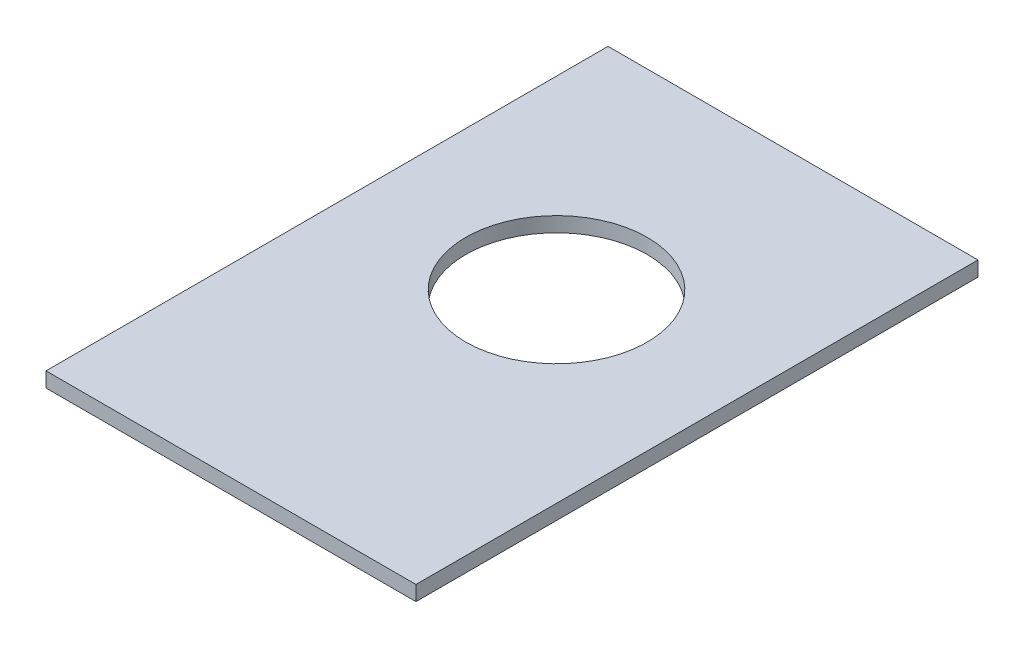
ISO-10303-21;
HEADER;
FILE_DESCRIPTION(('STEP AP214'),'2;1');
FILE_NAME('part.step','',(''),(''),'','','');
FILE_SCHEMA(('AUTOMOTIVE_DESIGN { 1 0 10303 214 1 1 1 1 }'));
ENDSEC;
DATA;
#1=APPLICATION_CONTEXT('core data for automotive mechanical design processes');
#2=APPLICATION_PROTOCOL_DEFINITION('international standard','automotive_design',2000,#1);
#3=PRODUCT_CONTEXT('',#1,'mechanical');
#4=PRODUCT('Part','Part','',(#3));
#5=PRODUCT_RELATED_PRODUCT_CATEGORY('part','',(#4));
#6=PRODUCT_DEFINITION_FORMATION('','',#4);
#7=PRODUCT_DEFINITION_CONTEXT('part definition',#1,'design');
#8=PRODUCT_DEFINITION('design','',#6,#7);
#9=PRODUCT_DEFINITION_SHAPE('','',#8);
#10=(LENGTH_UNIT() NAMED_UNIT(*) SI_UNIT(.MILLI.,.METRE.));
#11=(NAMED_UNIT(*) PLANE_ANGLE_UNIT() SI_UNIT($,.RADIAN.));
#12=(NAMED_UNIT(*) SI_UNIT($,.STERADIAN.) SOLID_ANGLE_UNIT());
#13=UNCERTAINTY_MEASURE_WITH_UNIT(LENGTH_MEASURE(1.E-05),#10,'distance_accuracy_value','');
#14=(GEOMETRIC_REPRESENTATION_CONTEXT(3) GLOBAL_UNCERTAINTY_ASSIGNED_CONTEXT((#13)) GLOBAL_UNIT_ASSIGNED_CONTEXT((#10,
#11,#12)) REPRESENTATION_CONTEXT('',''));
#15=CARTESIAN_POINT('',(0.,0.,0.));
#16=DIRECTION('',(0.,0.,1.));
#17=DIRECTION('',(1.,0.,0.));
#18=AXIS2_PLACEMENT_3D('',#15,#16,#17);
#19=CARTESIAN_POINT('',(-50.8,-16.792583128,-64.9508099));
#20=DIRECTION('',(0.,0.,1.));
#21=DIRECTION('',(1.,0.,0.));
#22=AXIS2_PLACEMENT_3D('',#19,#20,#21);
#23=PLANE('',#22);
#24=DIRECTION('',(1.,0.,0.));
#25=VECTOR('',#24,1.);
#26=CARTESIAN_POINT('',(0.,-12.7,-64.9508099));
#27=LINE('',#26,#25);
#28=CARTESIAN_POINT('',(-50.8,-12.7,-64.9508099));
#29=VERTEX_POINT('',#28);
#30=CARTESIAN_POINT('',(50.8,-12.7,-64.9508099));
#31=VERTEX_POINT('',#30);
#32=EDGE_CURVE('E45',#29,#31,#27,.T.);
#33=ORIENTED_EDGE('',*,*,#32,.T.);
#34=DIRECTION('',(0.,1.,0.));
#35=VECTOR('',#34,1.);
#36=CARTESIAN_POINT('',(50.8,-14.746291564,-64.9508099));
#37=LINE('',#36,#35);
#38=CARTESIAN_POINT('',(50.8,-16.792583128,-64.9508099));
#39=VERTEX_POINT('',#38);
#40=EDGE_CURVE('E72',#39,#31,#37,.T.);
#41=ORIENTED_EDGE('',*,*,#40,.F.);
#42=DIRECTION('',(-1.,0.,0.));
#43=VECTOR('',#42,1.);
#44=CARTESIAN_POINT('',(0.,-16.792583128,-64.9508099));
#45=LINE('',#44,#43);
#46=CARTESIAN_POINT('',(-50.8,-16.792583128,-64.9508099));
#47=VERTEX_POINT('',#46);
#48=EDGE_CURVE('E77',#39,#47,#45,.T.);
#49=ORIENTED_EDGE('',*,*,#48,.T.);
#50=DIRECTION('',(0.,1.,0.));
#51=VECTOR('',#50,1.);
#52=CARTESIAN_POINT('',(-50.8,-14.746291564,-64.9508099));
#53=LINE('',#52,#51);
#54=EDGE_CURVE('E51',#47,#29,#53,.T.);
#55=ORIENTED_EDGE('',*,*,#54,.T.);
#56=EDGE_LOOP('',(#33,#41,#49,#55));
#57=FACE_BOUND('',#56,.T.);
#58=ADVANCED_FACE('F15',(#57),#23,.F.);
#59=CARTESIAN_POINT('',(50.8,-16.792583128,89.3980392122));
#60=DIRECTION('',(1.,0.,0.));
#61=DIRECTION('',(0.,0.,-1.));
#62=AXIS2_PLACEMENT_3D('',#59,#60,#61);
#63=PLANE('',#62);
#64=ORIENTED_EDGE('',*,*,#40,.T.);
#65=DIRECTION('',(0.,0.,1.));
#66=VECTOR('',#65,1.);
#67=CARTESIAN_POINT('',(50.8,-12.7,12.2236146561));
#68=LINE('',#67,#66);
#69=CARTESIAN_POINT('',(50.8,-12.7,89.3980392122));
#70=VERTEX_POINT('',#69);
#71=EDGE_CURVE('E68',#31,#70,#68,.T.);
#72=ORIENTED_EDGE('',*,*,#71,.T.);
#73=DIRECTION('',(0.,-1.,0.));
#74=VECTOR('',#73,1.);
#75=CARTESIAN_POINT('',(50.8,-14.746291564,89.3980392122));
#76=LINE('',#75,#74);
#77=CARTESIAN_POINT('',(50.8,-16.792583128,89.3980392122));
#78=VERTEX_POINT('',#77);
#79=EDGE_CURVE('E65',#70,#78,#76,.T.);
#80=ORIENTED_EDGE('',*,*,#79,.T.);
#81=DIRECTION('',(0.,0.,-1.));
#82=VECTOR('',#81,1.);
#83=CARTESIAN_POINT('',(50.8,-16.792583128,12.2236146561));
#84=LINE('',#83,#82);
#85=EDGE_CURVE('E67',#78,#39,#84,.T.);
#86=ORIENTED_EDGE('',*,*,#85,.T.);
#87=EDGE_LOOP('',(#64,#72,#80,#86));
#88=FACE_BOUND('',#87,.T.);
#89=ADVANCED_FACE('F66',(#88),#63,.T.);
#90=CARTESIAN_POINT('',(50.8,-16.792583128,89.3980392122));
#91=DIRECTION('',(0.,0.,-1.));
#92=DIRECTION('',(-1.,0.,0.));
#93=AXIS2_PLACEMENT_3D('',#90,#91,#92);
#94=PLANE('',#93);
#95=DIRECTION('',(1.,0.,0.));
#96=VECTOR('',#95,1.);
#97=CARTESIAN_POINT('',(0.,-16.792583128,89.3980392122));
#98=LINE('',#97,#96);
#99=CARTESIAN_POINT('',(-50.8,-16.792583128,89.3980392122));
#100=VERTEX_POINT('',#99);
#101=EDGE_CURVE('E60',#100,#78,#98,.T.);
#102=ORIENTED_EDGE('',*,*,#101,.T.);
#103=ORIENTED_EDGE('',*,*,#79,.F.);
#104=DIRECTION('',(-1.,0.,0.));
#105=VECTOR('',#104,1.);
#106=CARTESIAN_POINT('',(0.,-12.7,89.3980392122));
#107=LINE('',#106,#105);
#108=CARTESIAN_POINT('',(-50.8,-12.7,89.3980392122));
#109=VERTEX_POINT('',#108);
#110=EDGE_CURVE('E86',#70,#109,#107,.T.);
#111=ORIENTED_EDGE('',*,*,#110,.T.);
#112=DIRECTION('',(0.,-1.,0.));
#113=VECTOR('',#112,1.);
#114=CARTESIAN_POINT('',(-50.8,-14.746291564,89.3980392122));
#115=LINE('',#114,#113);
#116=EDGE_CURVE('E32',#109,#100,#115,.T.);
#117=ORIENTED_EDGE('',*,*,#116,.T.);
#118=EDGE_LOOP('',(#102,#103,#111,#117));
#119=FACE_BOUND('',#118,.T.);
#120=ADVANCED_FACE('F79',(#119),#94,.F.);
#121=CARTESIAN_POINT('',(-50.8,-16.792583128,89.3980392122));
#122=DIRECTION('',(1.,0.,0.));
#123=DIRECTION('',(0.,0.,-1.));
#124=AXIS2_PLACEMENT_3D('',#121,#122,#123);
#125=PLANE('',#124);
#126=DIRECTION('',(0.,0.,-1.));
#127=VECTOR('',#126,1.);
#128=CARTESIAN_POINT('',(-50.8,-12.7,12.2236146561));
#129=LINE('',#128,#127);
#130=EDGE_CURVE('E84',#109,#29,#129,.T.);
#131=ORIENTED_EDGE('',*,*,#130,.T.);
#132=ORIENTED_EDGE('',*,*,#54,.F.);
#133=DIRECTION('',(0.,0.,1.));
#134=VECTOR('',#133,1.);
#135=CARTESIAN_POINT('',(-50.8,-16.792583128,12.2236146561));
#136=LINE('',#135,#134);
#137=EDGE_CURVE('E89',#47,#100,#136,.T.);
#138=ORIENTED_EDGE('',*,*,#137,.T.);
#139=ORIENTED_EDGE('',*,*,#116,.F.);
#140=EDGE_LOOP('',(#131,#132,#138,#139));
#141=FACE_BOUND('',#140,.T.);
#142=ADVANCED_FACE('F94',(#141),#125,.F.);
#143=CARTESIAN_POINT('',(-50.8,-16.792583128,-64.9508099));
#144=DIRECTION('',(0.,1.,0.));
#145=DIRECTION('',(0.,0.,1.));
#146=AXIS2_PLACEMENT_3D('',#143,#144,#145);
#147=PLANE('',#146);
#148=CARTESIAN_POINT('',(0.,-16.792583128,0.));
#149=DIRECTION('',(0.,1.,0.));
#150=DIRECTION('',(0.,0.,1.));
#151=AXIS2_PLACEMENT_3D('',#148,#149,#150);
#152=CIRCLE('',#151,24.92375);
#153=CARTESIAN_POINT('',(0.,-16.792583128,24.92375));
#154=VERTEX_POINT('',#153);
#155=EDGE_CURVE('E19',#154,#154,#152,.F.);
#156=ORIENTED_EDGE('',*,*,#155,.F.);
#157=EDGE_LOOP('',(#156));
#158=FACE_BOUND('',#157,.T.);
#159=ORIENTED_EDGE('',*,*,#48,.F.);
#160=ORIENTED_EDGE('',*,*,#85,.F.);
#161=ORIENTED_EDGE('',*,*,#101,.F.);
#162=ORIENTED_EDGE('',*,*,#137,.F.);
#163=EDGE_LOOP('',(#159,#160,#161,#162));
#164=FACE_BOUND('',#163,.T.);
#165=ADVANCED_FACE('F75',(#158,#164),#147,.F.);
#166=CARTESIAN_POINT('',(-50.8,-12.7,89.3980392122));
#167=DIRECTION('',(0.,-1.,0.));
#168=DIRECTION('',(0.,0.,-1.));
#169=AXIS2_PLACEMENT_3D('',#166,#167,#168);
#170=PLANE('',#169);
#171=CARTESIAN_POINT('',(0.,-12.7,0.));
#172=DIRECTION('',(0.,1.,0.));
#173=DIRECTION('',(0.,0.,1.));
#174=AXIS2_PLACEMENT_3D('',#171,#172,#173);
#175=CIRCLE('',#174,24.92375);
#176=CARTESIAN_POINT('',(0.,-12.7,24.92375));
#177=VERTEX_POINT('',#176);
#178=EDGE_CURVE('E10',#177,#177,#175,.T.);
#179=ORIENTED_EDGE('',*,*,#178,.F.);
#180=EDGE_LOOP('',(#179));
#181=FACE_BOUND('',#180,.T.);
#182=ORIENTED_EDGE('',*,*,#110,.F.);
#183=ORIENTED_EDGE('',*,*,#71,.F.);
#184=ORIENTED_EDGE('',*,*,#32,.F.);
#185=ORIENTED_EDGE('',*,*,#130,.F.);
#186=EDGE_LOOP('',(#182,#183,#184,#185));
#187=FACE_BOUND('',#186,.T.);
#188=ADVANCED_FACE('F17',(#181,#187),#170,.F.);
#189=CARTESIAN_POINT('',(0.,-16.792583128,0.));
#190=DIRECTION('',(0.,1.,0.));
#191=DIRECTION('',(0.,0.,1.));
#192=AXIS2_PLACEMENT_3D('',#189,#190,#191);
#193=CYLINDRICAL_SURFACE('',#192,24.92375);
#194=ORIENTED_EDGE('',*,*,#178,.T.);
#195=EDGE_LOOP('',(#194));
#196=FACE_BOUND('',#195,.T.);
#197=ORIENTED_EDGE('',*,*,#155,.T.);
#198=EDGE_LOOP('',(#197));
#199=FACE_BOUND('',#198,.T.);
#200=ADVANCED_FACE('F104',(#196,#199),#193,.F.);
#201=CLOSED_SHELL('',(#58,#89,#120,#142,#165,#188,#200));
#202=MANIFOLD_SOLID_BREP('B1',#201);
#203=ADVANCED_BREP_SHAPE_REPRESENTATION('',(#18,#202),#14);
#204=SHAPE_DEFINITION_REPRESENTATION(#9,#203);
ENDSEC;
END-ISO-10303-21;
